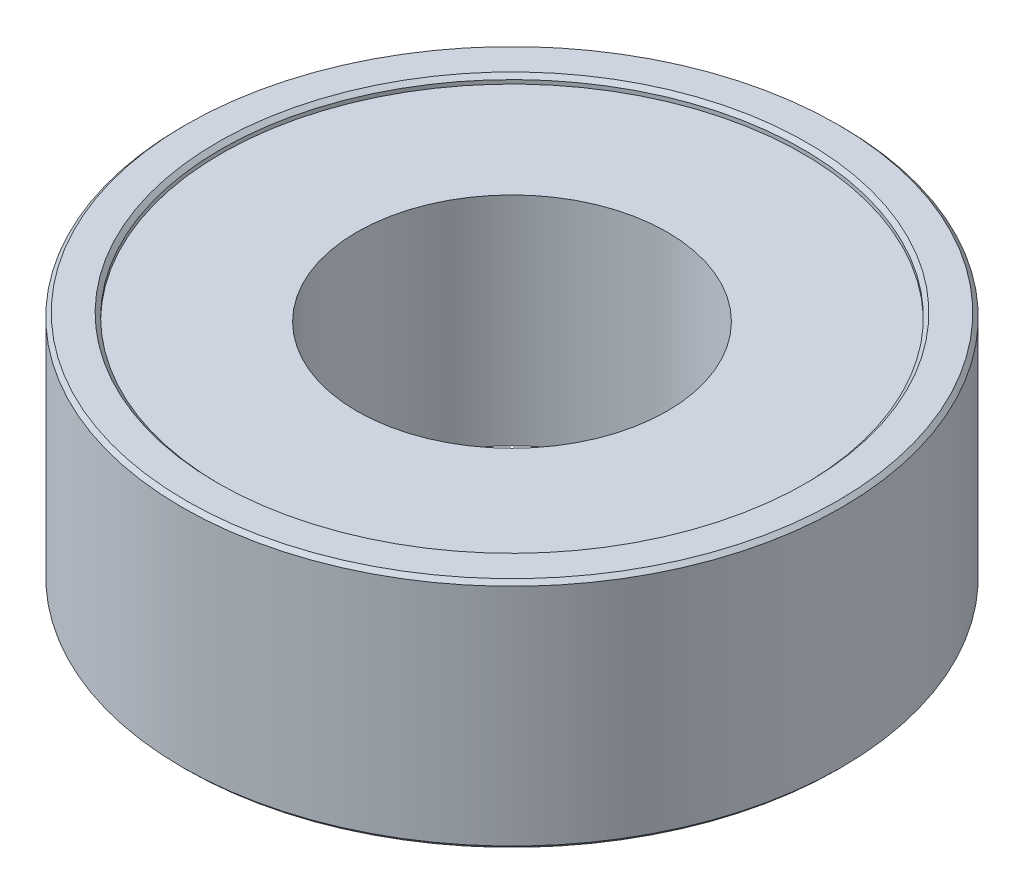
ISO-10303-21;
HEADER;
FILE_DESCRIPTION(('STEP AP214'),'2;1');
FILE_NAME('part.step','',(''),(''),'','','');
FILE_SCHEMA(('AUTOMOTIVE_DESIGN { 1 0 10303 214 1 1 1 1 }'));
ENDSEC;
DATA;
#1=APPLICATION_CONTEXT('core data for automotive mechanical design processes');
#2=APPLICATION_PROTOCOL_DEFINITION('international standard','automotive_design',2000,#1);
#3=PRODUCT_CONTEXT('',#1,'mechanical');
#4=PRODUCT('Part','Part','',(#3));
#5=PRODUCT_RELATED_PRODUCT_CATEGORY('part','',(#4));
#6=PRODUCT_DEFINITION_FORMATION('','',#4);
#7=PRODUCT_DEFINITION_CONTEXT('part definition',#1,'design');
#8=PRODUCT_DEFINITION('design','',#6,#7);
#9=PRODUCT_DEFINITION_SHAPE('','',#8);
#10=(LENGTH_UNIT() NAMED_UNIT(*) SI_UNIT(.MILLI.,.METRE.));
#11=(NAMED_UNIT(*) PLANE_ANGLE_UNIT() SI_UNIT($,.RADIAN.));
#12=(NAMED_UNIT(*) SI_UNIT($,.STERADIAN.) SOLID_ANGLE_UNIT());
#13=UNCERTAINTY_MEASURE_WITH_UNIT(LENGTH_MEASURE(1.E-05),#10,'distance_accuracy_value','');
#14=(GEOMETRIC_REPRESENTATION_CONTEXT(3) GLOBAL_UNCERTAINTY_ASSIGNED_CONTEXT((#13)) GLOBAL_UNIT_ASSIGNED_CONTEXT((#10,
#11,#12)) REPRESENTATION_CONTEXT('',''));
#15=CARTESIAN_POINT('',(0.,0.,0.));
#16=DIRECTION('',(0.,0.,1.));
#17=DIRECTION('',(1.,0.,0.));
#18=AXIS2_PLACEMENT_3D('',#15,#16,#17);
#19=CARTESIAN_POINT('',(0.,3.,0.));
#20=DIRECTION('',(0.,1.,0.));
#21=DIRECTION('',(0.,0.,1.));
#22=AXIS2_PLACEMENT_3D('',#19,#20,#21);
#23=CYLINDRICAL_SURFACE('',#22,4.);
#24=CARTESIAN_POINT('',(0.,5.8,0.));
#25=DIRECTION('',(0.,1.,0.));
#26=DIRECTION('',(0.,0.,1.));
#27=AXIS2_PLACEMENT_3D('',#24,#25,#26);
#28=CIRCLE('',#27,4.);
#29=CARTESIAN_POINT('',(0.,5.8,4.));
#30=VERTEX_POINT('',#29);
#31=EDGE_CURVE('E52',#30,#30,#28,.F.);
#32=ORIENTED_EDGE('',*,*,#31,.F.);
#33=EDGE_LOOP('',(#32));
#34=FACE_BOUND('',#33,.T.);
#35=CARTESIAN_POINT('',(0.,0.2,0.));
#36=DIRECTION('',(0.,1.,0.));
#37=DIRECTION('',(0.,0.,1.));
#38=AXIS2_PLACEMENT_3D('',#35,#36,#37);
#39=CIRCLE('',#38,4.);
#40=CARTESIAN_POINT('',(0.,0.2,4.));
#41=VERTEX_POINT('',#40);
#42=EDGE_CURVE('E18',#41,#41,#39,.F.);
#43=ORIENTED_EDGE('',*,*,#42,.T.);
#44=EDGE_LOOP('',(#43));
#45=FACE_BOUND('',#44,.T.);
#46=ADVANCED_FACE('F15',(#34,#45),#23,.F.);
#47=CARTESIAN_POINT('',(0.,0.2,0.));
#48=DIRECTION('',(0.,1.,0.));
#49=DIRECTION('',(0.,0.,1.));
#50=AXIS2_PLACEMENT_3D('',#47,#48,#49);
#51=PLANE('',#50);
#52=CARTESIAN_POINT('',(0.,0.2,0.));
#53=DIRECTION('',(0.,1.,0.));
#54=DIRECTION('',(0.,0.,1.));
#55=AXIS2_PLACEMENT_3D('',#52,#53,#54);
#56=CIRCLE('',#55,7.5);
#57=CARTESIAN_POINT('',(0.,0.2,7.5));
#58=VERTEX_POINT('',#57);
#59=EDGE_CURVE('E50',#58,#58,#56,.F.);
#60=ORIENTED_EDGE('',*,*,#59,.T.);
#61=EDGE_LOOP('',(#60));
#62=FACE_BOUND('',#61,.T.);
#63=ORIENTED_EDGE('',*,*,#42,.F.);
#64=EDGE_LOOP('',(#63));
#65=FACE_BOUND('',#64,.T.);
#66=ADVANCED_FACE('F60',(#62,#65),#51,.F.);
#67=CARTESIAN_POINT('',(0.,5.8,0.));
#68=DIRECTION('',(0.,1.,0.));
#69=DIRECTION('',(0.,0.,1.));
#70=AXIS2_PLACEMENT_3D('',#67,#68,#69);
#71=PLANE('',#70);
#72=CARTESIAN_POINT('',(0.,5.8,0.));
#73=DIRECTION('',(0.,1.,0.));
#74=DIRECTION('',(0.,0.,1.));
#75=AXIS2_PLACEMENT_3D('',#72,#73,#74);
#76=CIRCLE('',#75,7.5);
#77=CARTESIAN_POINT('',(0.,5.8,7.5));
#78=VERTEX_POINT('',#77);
#79=EDGE_CURVE('E37',#78,#78,#76,.T.);
#80=ORIENTED_EDGE('',*,*,#79,.T.);
#81=EDGE_LOOP('',(#80));
#82=FACE_BOUND('',#81,.T.);
#83=ORIENTED_EDGE('',*,*,#31,.T.);
#84=EDGE_LOOP('',(#83));
#85=FACE_BOUND('',#84,.T.);
#86=ADVANCED_FACE('F62',(#82,#85),#71,.T.);
#87=CARTESIAN_POINT('',(0.,0.1,0.));
#88=DIRECTION('',(0.,1.,0.));
#89=DIRECTION('',(0.,0.,1.));
#90=AXIS2_PLACEMENT_3D('',#87,#88,#89);
#91=CYLINDRICAL_SURFACE('',#90,7.5);
#92=ORIENTED_EDGE('',*,*,#59,.F.);
#93=EDGE_LOOP('',(#92));
#94=FACE_BOUND('',#93,.T.);
#95=CARTESIAN_POINT('',(0.,0.100000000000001,0.));
#96=DIRECTION('',(0.,-1.,0.));
#97=DIRECTION('',(-1.,0.,0.));
#98=AXIS2_PLACEMENT_3D('',#95,#96,#97);
#99=CIRCLE('',#98,7.5);
#100=CARTESIAN_POINT('',(-7.5,0.100000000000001,0.));
#101=VERTEX_POINT('',#100);
#102=EDGE_CURVE('E34',#101,#101,#99,.T.);
#103=ORIENTED_EDGE('',*,*,#102,.T.);
#104=EDGE_LOOP('',(#103));
#105=FACE_BOUND('',#104,.T.);
#106=ADVANCED_FACE('F69',(#94,#105),#91,.F.);
#107=CARTESIAN_POINT('',(0.,5.9,0.));
#108=DIRECTION('',(0.,1.,0.));
#109=DIRECTION('',(0.,0.,1.));
#110=AXIS2_PLACEMENT_3D('',#107,#108,#109);
#111=CYLINDRICAL_SURFACE('',#110,7.5);
#112=CARTESIAN_POINT('',(0.,5.9,0.));
#113=DIRECTION('',(0.,1.,0.));
#114=DIRECTION('',(-1.,0.,0.));
#115=AXIS2_PLACEMENT_3D('',#112,#113,#114);
#116=CIRCLE('',#115,7.5);
#117=CARTESIAN_POINT('',(-7.5,5.9,0.));
#118=VERTEX_POINT('',#117);
#119=EDGE_CURVE('E30',#118,#118,#116,.T.);
#120=ORIENTED_EDGE('',*,*,#119,.T.);
#121=EDGE_LOOP('',(#120));
#122=FACE_BOUND('',#121,.T.);
#123=ORIENTED_EDGE('',*,*,#79,.F.);
#124=EDGE_LOOP('',(#123));
#125=FACE_BOUND('',#124,.T.);
#126=ADVANCED_FACE('F103',(#122,#125),#111,.F.);
#127=CARTESIAN_POINT('',(0.,0.,0.));
#128=DIRECTION('',(0.,-1.,0.));
#129=DIRECTION('',(0.,0.,-1.));
#130=AXIS2_PLACEMENT_3D('',#127,#128,#129);
#131=CONICAL_SURFACE('',#130,7.6,0.785398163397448);
#132=CARTESIAN_POINT('',(0.,0.,0.));
#133=DIRECTION('',(0.,-1.,0.));
#134=DIRECTION('',(0.,0.,-1.));
#135=AXIS2_PLACEMENT_3D('',#132,#133,#134);
#136=CIRCLE('',#135,7.6);
#137=CARTESIAN_POINT('',(0.,0.,-7.6));
#138=VERTEX_POINT('',#137);
#139=EDGE_CURVE('E33',#138,#138,#136,.F.);
#140=ORIENTED_EDGE('',*,*,#139,.F.);
#141=EDGE_LOOP('',(#140));
#142=FACE_BOUND('',#141,.T.);
#143=ORIENTED_EDGE('',*,*,#102,.F.);
#144=EDGE_LOOP('',(#143));
#145=FACE_BOUND('',#144,.T.);
#146=ADVANCED_FACE('F99',(#142,#145),#131,.F.);
#147=CARTESIAN_POINT('',(0.,6.,0.));
#148=DIRECTION('',(0.,1.,0.));
#149=DIRECTION('',(0.,0.,1.));
#150=AXIS2_PLACEMENT_3D('',#147,#148,#149);
#151=CONICAL_SURFACE('',#150,7.6,0.785398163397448);
#152=ORIENTED_EDGE('',*,*,#119,.F.);
#153=EDGE_LOOP('',(#152));
#154=FACE_BOUND('',#153,.T.);
#155=CARTESIAN_POINT('',(0.,6.,0.));
#156=DIRECTION('',(0.,1.,0.));
#157=DIRECTION('',(0.,0.,1.));
#158=AXIS2_PLACEMENT_3D('',#155,#156,#157);
#159=CIRCLE('',#158,7.6);
#160=CARTESIAN_POINT('',(0.,6.,7.6));
#161=VERTEX_POINT('',#160);
#162=EDGE_CURVE('E43',#161,#161,#159,.T.);
#163=ORIENTED_EDGE('',*,*,#162,.T.);
#164=EDGE_LOOP('',(#163));
#165=FACE_BOUND('',#164,.T.);
#166=ADVANCED_FACE('F95',(#154,#165),#151,.F.);
#167=CARTESIAN_POINT('',(0.,0.,0.));
#168=DIRECTION('',(0.,-1.,0.));
#169=DIRECTION('',(0.,0.,-1.));
#170=AXIS2_PLACEMENT_3D('',#167,#168,#169);
#171=PLANE('',#170);
#172=CARTESIAN_POINT('',(0.,0.,0.));
#173=DIRECTION('',(0.,1.,0.));
#174=DIRECTION('',(0.,0.,1.));
#175=AXIS2_PLACEMENT_3D('',#172,#173,#174);
#176=CIRCLE('',#175,8.4);
#177=CARTESIAN_POINT('',(0.,0.,8.4));
#178=VERTEX_POINT('',#177);
#179=EDGE_CURVE('E40',#178,#178,#176,.T.);
#180=ORIENTED_EDGE('',*,*,#179,.F.);
#181=EDGE_LOOP('',(#180));
#182=FACE_BOUND('',#181,.T.);
#183=ORIENTED_EDGE('',*,*,#139,.T.);
#184=EDGE_LOOP('',(#183));
#185=FACE_BOUND('',#184,.T.);
#186=ADVANCED_FACE('F91',(#182,#185),#171,.T.);
#187=CARTESIAN_POINT('',(0.,6.,0.));
#188=DIRECTION('',(0.,-1.,0.));
#189=DIRECTION('',(0.,0.,-1.));
#190=AXIS2_PLACEMENT_3D('',#187,#188,#189);
#191=PLANE('',#190);
#192=CARTESIAN_POINT('',(0.,6.,0.));
#193=DIRECTION('',(0.,-1.,0.));
#194=DIRECTION('',(0.,0.,-1.));
#195=AXIS2_PLACEMENT_3D('',#192,#193,#194);
#196=CIRCLE('',#195,8.4);
#197=CARTESIAN_POINT('',(0.,6.,-8.4));
#198=VERTEX_POINT('',#197);
#199=EDGE_CURVE('E27',#198,#198,#196,.T.);
#200=ORIENTED_EDGE('',*,*,#199,.F.);
#201=EDGE_LOOP('',(#200));
#202=FACE_BOUND('',#201,.T.);
#203=ORIENTED_EDGE('',*,*,#162,.F.);
#204=EDGE_LOOP('',(#203));
#205=FACE_BOUND('',#204,.T.);
#206=ADVANCED_FACE('F87',(#202,#205),#191,.F.);
#207=CARTESIAN_POINT('',(0.,0.0999999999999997,0.));
#208=DIRECTION('',(0.,1.,0.));
#209=DIRECTION('',(0.,0.,1.));
#210=AXIS2_PLACEMENT_3D('',#207,#208,#209);
#211=CONICAL_SURFACE('',#210,8.5,0.785398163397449);
#212=ORIENTED_EDGE('',*,*,#179,.T.);
#213=EDGE_LOOP('',(#212));
#214=FACE_BOUND('',#213,.T.);
#215=CARTESIAN_POINT('',(0.,0.1,0.));
#216=DIRECTION('',(0.,1.,0.));
#217=DIRECTION('',(0.,0.,1.));
#218=AXIS2_PLACEMENT_3D('',#215,#216,#217);
#219=CIRCLE('',#218,8.5);
#220=CARTESIAN_POINT('',(0.,0.1,8.5));
#221=VERTEX_POINT('',#220);
#222=EDGE_CURVE('E22',#221,#221,#219,.T.);
#223=ORIENTED_EDGE('',*,*,#222,.F.);
#224=EDGE_LOOP('',(#223));
#225=FACE_BOUND('',#224,.T.);
#226=ADVANCED_FACE('F80',(#214,#225),#211,.T.);
#227=CARTESIAN_POINT('',(0.,5.9,0.));
#228=DIRECTION('',(0.,-1.,0.));
#229=DIRECTION('',(0.,0.,-1.));
#230=AXIS2_PLACEMENT_3D('',#227,#228,#229);
#231=CONICAL_SURFACE('',#230,8.5,0.785398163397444);
#232=CARTESIAN_POINT('',(0.,5.9,0.));
#233=DIRECTION('',(0.,1.,0.));
#234=DIRECTION('',(0.,0.,1.));
#235=AXIS2_PLACEMENT_3D('',#232,#233,#234);
#236=CIRCLE('',#235,8.5);
#237=CARTESIAN_POINT('',(0.,5.9,8.5));
#238=VERTEX_POINT('',#237);
#239=EDGE_CURVE('E10',#238,#238,#236,.F.);
#240=ORIENTED_EDGE('',*,*,#239,.F.);
#241=EDGE_LOOP('',(#240));
#242=FACE_BOUND('',#241,.T.);
#243=ORIENTED_EDGE('',*,*,#199,.T.);
#244=EDGE_LOOP('',(#243));
#245=FACE_BOUND('',#244,.T.);
#246=ADVANCED_FACE('F75',(#242,#245),#231,.T.);
#247=CARTESIAN_POINT('',(0.,4.5,0.));
#248=DIRECTION('',(0.,1.,0.));
#249=DIRECTION('',(0.,0.,1.));
#250=AXIS2_PLACEMENT_3D('',#247,#248,#249);
#251=CYLINDRICAL_SURFACE('',#250,8.5);
#252=ORIENTED_EDGE('',*,*,#239,.T.);
#253=EDGE_LOOP('',(#252));
#254=FACE_BOUND('',#253,.T.);
#255=ORIENTED_EDGE('',*,*,#222,.T.);
#256=EDGE_LOOP('',(#255));
#257=FACE_BOUND('',#256,.T.);
#258=ADVANCED_FACE('F73',(#254,#257),#251,.T.);
#259=CLOSED_SHELL('',(#46,#66,#86,#106,#126,#146,#166,#186,#206,#226,#246,#258));
#260=MANIFOLD_SOLID_BREP('B1',#259);
#261=ADVANCED_BREP_SHAPE_REPRESENTATION('',(#18,#260),#14);
#262=SHAPE_DEFINITION_REPRESENTATION(#9,#261);
ENDSEC;
END-ISO-10303-21;
